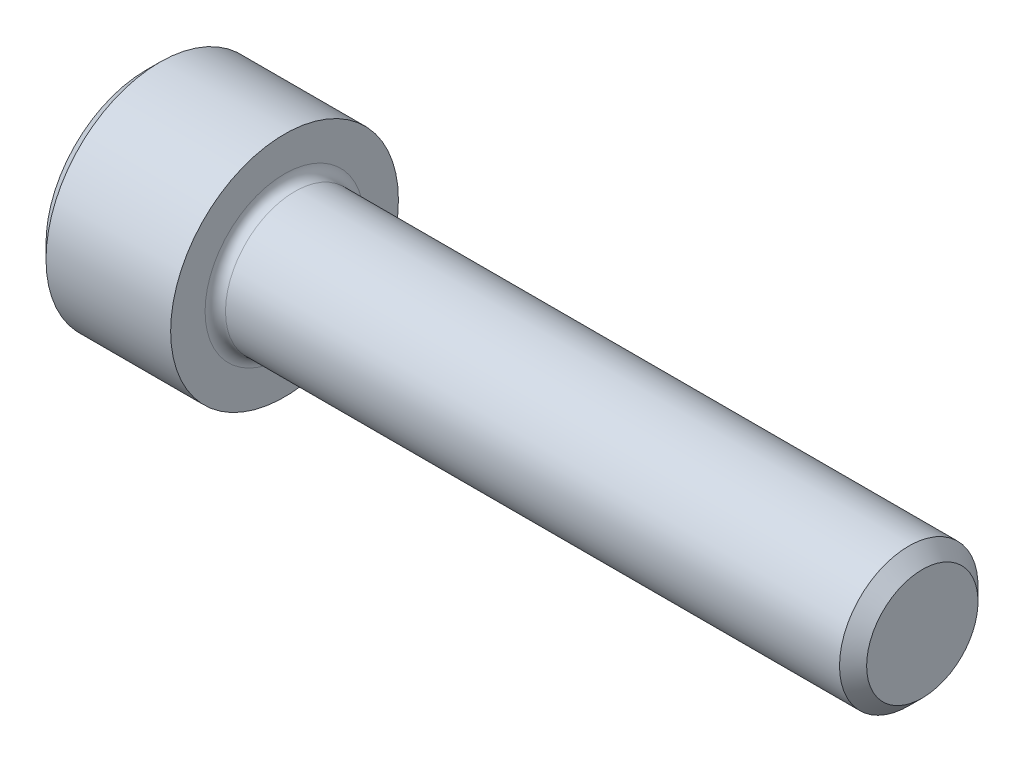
ISO-10303-21;
HEADER;
FILE_DESCRIPTION(('STEP AP214'),'2;1');
FILE_NAME('part.step','',(''),(''),'','','');
FILE_SCHEMA(('AUTOMOTIVE_DESIGN { 1 0 10303 214 1 1 1 1 }'));
ENDSEC;
DATA;
#1=APPLICATION_CONTEXT('core data for automotive mechanical design processes');
#2=APPLICATION_PROTOCOL_DEFINITION('international standard','automotive_design',2000,#1);
#3=PRODUCT_CONTEXT('',#1,'mechanical');
#4=PRODUCT('Part','Part','',(#3));
#5=PRODUCT_RELATED_PRODUCT_CATEGORY('part','',(#4));
#6=PRODUCT_DEFINITION_FORMATION('','',#4);
#7=PRODUCT_DEFINITION_CONTEXT('part definition',#1,'design');
#8=PRODUCT_DEFINITION('design','',#6,#7);
#9=PRODUCT_DEFINITION_SHAPE('','',#8);
#10=(LENGTH_UNIT() NAMED_UNIT(*) SI_UNIT(.MILLI.,.METRE.));
#11=(NAMED_UNIT(*) PLANE_ANGLE_UNIT() SI_UNIT($,.RADIAN.));
#12=(NAMED_UNIT(*) SI_UNIT($,.STERADIAN.) SOLID_ANGLE_UNIT());
#13=UNCERTAINTY_MEASURE_WITH_UNIT(LENGTH_MEASURE(1.E-05),#10,'distance_accuracy_value','');
#14=(GEOMETRIC_REPRESENTATION_CONTEXT(3) GLOBAL_UNCERTAINTY_ASSIGNED_CONTEXT((#13)) GLOBAL_UNIT_ASSIGNED_CONTEXT((#10,
#11,#12)) REPRESENTATION_CONTEXT('',''));
#15=CARTESIAN_POINT('',(0.,0.,0.));
#16=DIRECTION('',(0.,0.,1.));
#17=DIRECTION('',(1.,0.,0.));
#18=AXIS2_PLACEMENT_3D('',#15,#16,#17);
#19=CARTESIAN_POINT('',(2.286,3.4381381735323,-1.98501000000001));
#20=DIRECTION('',(1.,0.,0.));
#21=DIRECTION('',(0.,0.,-1.));
#22=AXIS2_PLACEMENT_3D('',#19,#20,#21);
#23=PLANE('',#22);
#24=DIRECTION('',(0.,1.,0.));
#25=VECTOR('',#24,1.);
#26=CARTESIAN_POINT('',(2.286,3.4381381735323,1.98501));
#27=LINE('',#26,#25);
#28=CARTESIAN_POINT('',(2.28599999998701,0.,1.98501000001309));
#29=VERTEX_POINT('',#28);
#30=CARTESIAN_POINT('',(2.286,-1.14604605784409,1.98501));
#31=VERTEX_POINT('',#30);
#32=EDGE_CURVE('E95',#29,#31,#27,.F.);
#33=ORIENTED_EDGE('',*,*,#32,.F.);
#34=CARTESIAN_POINT('',(2.2859999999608,0.,0.));
#35=DIRECTION('',(-1.,0.,0.));
#36=DIRECTION('',(0.,0.,1.));
#37=AXIS2_PLACEMENT_3D('',#34,#35,#36);
#38=CIRCLE('',#37,1.98501000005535);
#39=CARTESIAN_POINT('',(2.2859999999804,-1.71906908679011,0.992505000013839));
#40=VERTEX_POINT('',#39);
#41=EDGE_CURVE('E97',#29,#40,#38,.F.);
#42=ORIENTED_EDGE('',*,*,#41,.T.);
#43=DIRECTION('',(0.,-0.500000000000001,-0.866025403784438));
#44=VECTOR('',#43,1.);
#45=CARTESIAN_POINT('',(2.286,-1.14604605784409,1.98501));
#46=LINE('',#45,#44);
#47=EDGE_CURVE('E100',#31,#40,#46,.T.);
#48=ORIENTED_EDGE('',*,*,#47,.F.);
#49=EDGE_LOOP('',(#33,#42,#48));
#50=FACE_BOUND('',#49,.T.);
#51=ADVANCED_FACE('F16',(#50),#23,.F.);
#52=CARTESIAN_POINT('',(2.286,3.4381381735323,-1.98501000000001));
#53=DIRECTION('',(1.,0.,0.));
#54=DIRECTION('',(0.,0.,-1.));
#55=AXIS2_PLACEMENT_3D('',#52,#53,#54);
#56=PLANE('',#55);
#57=DIRECTION('',(0.,-0.500000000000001,-0.866025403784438));
#58=VECTOR('',#57,1.);
#59=CARTESIAN_POINT('',(2.286,-1.71906908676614,0.992504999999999));
#60=LINE('',#59,#58);
#61=CARTESIAN_POINT('',(2.286,-2.29209211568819,0.));
#62=VERTEX_POINT('',#61);
#63=EDGE_CURVE('E168',#40,#62,#60,.T.);
#64=ORIENTED_EDGE('',*,*,#63,.F.);
#65=CARTESIAN_POINT('',(2.2859999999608,0.,0.));
#66=DIRECTION('',(-1.,0.,0.));
#67=DIRECTION('',(0.,0.,1.));
#68=AXIS2_PLACEMENT_3D('',#65,#66,#67);
#69=CIRCLE('',#68,1.98501000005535);
#70=CARTESIAN_POINT('',(2.2859999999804,-1.71906908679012,-0.992505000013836));
#71=VERTEX_POINT('',#70);
#72=EDGE_CURVE('E115',#40,#71,#69,.F.);
#73=ORIENTED_EDGE('',*,*,#72,.T.);
#74=DIRECTION('',(0.,0.499999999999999,-0.866025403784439));
#75=VECTOR('',#74,1.);
#76=CARTESIAN_POINT('',(2.286,-2.29209211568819,0.));
#77=LINE('',#76,#75);
#78=EDGE_CURVE('E164',#62,#71,#77,.T.);
#79=ORIENTED_EDGE('',*,*,#78,.F.);
#80=EDGE_LOOP('',(#64,#73,#79));
#81=FACE_BOUND('',#80,.T.);
#82=ADVANCED_FACE('F340',(#81),#56,.F.);
#83=CARTESIAN_POINT('',(2.286,3.4381381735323,-1.98501000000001));
#84=DIRECTION('',(1.,0.,0.));
#85=DIRECTION('',(0.,0.,-1.));
#86=AXIS2_PLACEMENT_3D('',#83,#84,#85);
#87=PLANE('',#86);
#88=DIRECTION('',(0.,0.499999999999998,-0.86602540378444));
#89=VECTOR('',#88,1.);
#90=CARTESIAN_POINT('',(2.286,-1.71906908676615,-0.992504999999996));
#91=LINE('',#90,#89);
#92=CARTESIAN_POINT('',(2.286,-1.1460460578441,-1.98501));
#93=VERTEX_POINT('',#92);
#94=EDGE_CURVE('E160',#71,#93,#91,.T.);
#95=ORIENTED_EDGE('',*,*,#94,.F.);
#96=CARTESIAN_POINT('',(2.2859999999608,0.,0.));
#97=DIRECTION('',(-1.,0.,0.));
#98=DIRECTION('',(0.,0.,1.));
#99=AXIS2_PLACEMENT_3D('',#96,#97,#98);
#100=CIRCLE('',#99,1.98501000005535);
#101=CARTESIAN_POINT('',(2.28599999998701,0.,-1.98501000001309));
#102=VERTEX_POINT('',#101);
#103=EDGE_CURVE('E217',#71,#102,#100,.F.);
#104=ORIENTED_EDGE('',*,*,#103,.T.);
#105=DIRECTION('',(0.,1.,0.));
#106=VECTOR('',#105,1.);
#107=CARTESIAN_POINT('',(2.286,3.4381381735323,-1.98501));
#108=LINE('',#107,#106);
#109=EDGE_CURVE('E156',#93,#102,#108,.T.);
#110=ORIENTED_EDGE('',*,*,#109,.F.);
#111=EDGE_LOOP('',(#95,#104,#110));
#112=FACE_BOUND('',#111,.T.);
#113=ADVANCED_FACE('F337',(#112),#87,.F.);
#114=CARTESIAN_POINT('',(2.286,3.4381381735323,-1.98501000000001));
#115=DIRECTION('',(1.,0.,0.));
#116=DIRECTION('',(0.,0.,-1.));
#117=AXIS2_PLACEMENT_3D('',#114,#115,#116);
#118=PLANE('',#117);
#119=DIRECTION('',(0.,1.,0.));
#120=VECTOR('',#119,1.);
#121=CARTESIAN_POINT('',(2.286,3.4381381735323,-1.98501));
#122=LINE('',#121,#120);
#123=CARTESIAN_POINT('',(2.286,1.1460460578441,-1.98501));
#124=VERTEX_POINT('',#123);
#125=EDGE_CURVE('E152',#102,#124,#122,.T.);
#126=ORIENTED_EDGE('',*,*,#125,.F.);
#127=CARTESIAN_POINT('',(2.2859999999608,0.,0.));
#128=DIRECTION('',(-1.,0.,0.));
#129=DIRECTION('',(0.,0.,1.));
#130=AXIS2_PLACEMENT_3D('',#127,#128,#129);
#131=CIRCLE('',#130,1.98501000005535);
#132=CARTESIAN_POINT('',(2.2859999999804,1.71906908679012,-0.992505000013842));
#133=VERTEX_POINT('',#132);
#134=EDGE_CURVE('E214',#102,#133,#131,.F.);
#135=ORIENTED_EDGE('',*,*,#134,.T.);
#136=DIRECTION('',(0.,0.500000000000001,0.866025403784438));
#137=VECTOR('',#136,1.);
#138=CARTESIAN_POINT('',(2.286,1.1460460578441,-1.98501));
#139=LINE('',#138,#137);
#140=EDGE_CURVE('E148',#124,#133,#139,.T.);
#141=ORIENTED_EDGE('',*,*,#140,.F.);
#142=EDGE_LOOP('',(#126,#135,#141));
#143=FACE_BOUND('',#142,.T.);
#144=ADVANCED_FACE('F333',(#143),#118,.F.);
#145=CARTESIAN_POINT('',(2.286,3.4381381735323,-1.98501000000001));
#146=DIRECTION('',(1.,0.,0.));
#147=DIRECTION('',(0.,0.,-1.));
#148=AXIS2_PLACEMENT_3D('',#145,#146,#147);
#149=PLANE('',#148);
#150=DIRECTION('',(0.,0.500000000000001,0.866025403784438));
#151=VECTOR('',#150,1.);
#152=CARTESIAN_POINT('',(2.286,1.71906908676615,-0.992505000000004));
#153=LINE('',#152,#151);
#154=CARTESIAN_POINT('',(2.286,2.2920921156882,0.));
#155=VERTEX_POINT('',#154);
#156=EDGE_CURVE('E144',#133,#155,#153,.T.);
#157=ORIENTED_EDGE('',*,*,#156,.F.);
#158=CARTESIAN_POINT('',(2.2859999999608,0.,0.));
#159=DIRECTION('',(-1.,0.,0.));
#160=DIRECTION('',(0.,0.,1.));
#161=AXIS2_PLACEMENT_3D('',#158,#159,#160);
#162=CIRCLE('',#161,1.98501000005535);
#163=CARTESIAN_POINT('',(2.2859999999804,1.71906908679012,0.992505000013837));
#164=VERTEX_POINT('',#163);
#165=EDGE_CURVE('E123',#133,#164,#162,.F.);
#166=ORIENTED_EDGE('',*,*,#165,.T.);
#167=DIRECTION('',(0.,-0.499999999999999,0.866025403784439));
#168=VECTOR('',#167,1.);
#169=CARTESIAN_POINT('',(2.286,2.2920921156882,0.));
#170=LINE('',#169,#168);
#171=EDGE_CURVE('E116',#155,#164,#170,.T.);
#172=ORIENTED_EDGE('',*,*,#171,.F.);
#173=EDGE_LOOP('',(#157,#166,#172));
#174=FACE_BOUND('',#173,.T.);
#175=ADVANCED_FACE('F329',(#174),#149,.F.);
#176=CARTESIAN_POINT('',(2.28600000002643,0.,0.));
#177=DIRECTION('',(-1.,0.,0.));
#178=DIRECTION('',(0.,0.,1.));
#179=AXIS2_PLACEMENT_3D('',#176,#177,#178);
#180=CONICAL_SURFACE('',#179,1.98500999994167,1.04719755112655);
#181=CARTESIAN_POINT('',(3.43204605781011,0.,5.6843418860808E-11));
#182=VERTEX_POINT('',#181);
#183=VERTEX_LOOP('',#182);
#184=FACE_BOUND('',#183,.T.);
#185=ORIENTED_EDGE('',*,*,#41,.F.);
#186=CARTESIAN_POINT('',(2.2859999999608,0.,0.));
#187=DIRECTION('',(-1.,0.,0.));
#188=DIRECTION('',(0.,0.,1.));
#189=AXIS2_PLACEMENT_3D('',#186,#187,#188);
#190=CIRCLE('',#189,1.98501000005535);
#191=EDGE_CURVE('E111',#29,#164,#190,.T.);
#192=ORIENTED_EDGE('',*,*,#191,.T.);
#193=ORIENTED_EDGE('',*,*,#165,.F.);
#194=ORIENTED_EDGE('',*,*,#134,.F.);
#195=ORIENTED_EDGE('',*,*,#103,.F.);
#196=ORIENTED_EDGE('',*,*,#72,.F.);
#197=EDGE_LOOP('',(#185,#192,#193,#194,#195,#196));
#198=FACE_BOUND('',#197,.T.);
#199=ADVANCED_FACE('F109',(#184,#198),#180,.F.);
#200=CARTESIAN_POINT('',(2.286,3.4381381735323,-1.98501000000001));
#201=DIRECTION('',(1.,0.,0.));
#202=DIRECTION('',(0.,0.,-1.));
#203=AXIS2_PLACEMENT_3D('',#200,#201,#202);
#204=PLANE('',#203);
#205=DIRECTION('',(0.,0.499999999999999,-0.866025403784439));
#206=VECTOR('',#205,1.);
#207=CARTESIAN_POINT('',(2.286,2.2920921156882,0.));
#208=LINE('',#207,#206);
#209=CARTESIAN_POINT('',(2.286,1.14604605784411,1.98501));
#210=VERTEX_POINT('',#209);
#211=EDGE_CURVE('E122',#164,#210,#208,.F.);
#212=ORIENTED_EDGE('',*,*,#211,.F.);
#213=ORIENTED_EDGE('',*,*,#191,.F.);
#214=DIRECTION('',(0.,-1.,0.));
#215=VECTOR('',#214,1.);
#216=CARTESIAN_POINT('',(2.286,-1.14604605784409,1.98501));
#217=LINE('',#216,#215);
#218=EDGE_CURVE('E120',#29,#210,#217,.F.);
#219=ORIENTED_EDGE('',*,*,#218,.T.);
#220=EDGE_LOOP('',(#212,#213,#219));
#221=FACE_BOUND('',#220,.T.);
#222=ADVANCED_FACE('F119',(#221),#204,.F.);
#223=CARTESIAN_POINT('',(2.286,2.2920921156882,0.));
#224=DIRECTION('',(0.,-0.866025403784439,-0.499999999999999));
#225=DIRECTION('',(0.,0.499999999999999,-0.866025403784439));
#226=AXIS2_PLACEMENT_3D('',#223,#224,#225);
#227=PLANE('',#226);
#228=ORIENTED_EDGE('',*,*,#211,.T.);
#229=DIRECTION('',(1.,0.,0.));
#230=VECTOR('',#229,1.);
#231=CARTESIAN_POINT('',(2.286,1.14604605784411,1.98501));
#232=LINE('',#231,#230);
#233=CARTESIAN_POINT('',(0.,1.14604605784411,1.98501));
#234=VERTEX_POINT('',#233);
#235=EDGE_CURVE('E128',#210,#234,#232,.F.);
#236=ORIENTED_EDGE('',*,*,#235,.T.);
#237=DIRECTION('',(0.,-0.499999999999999,0.866025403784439));
#238=VECTOR('',#237,1.);
#239=CARTESIAN_POINT('',(0.,2.2920921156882,0.));
#240=LINE('',#239,#238);
#241=CARTESIAN_POINT('',(0.,2.2920921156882,0.));
#242=VERTEX_POINT('',#241);
#243=EDGE_CURVE('E135',#242,#234,#240,.T.);
#244=ORIENTED_EDGE('',*,*,#243,.F.);
#245=DIRECTION('',(1.,0.,0.));
#246=VECTOR('',#245,1.);
#247=CARTESIAN_POINT('',(2.286,2.2920921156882,0.));
#248=LINE('',#247,#246);
#249=EDGE_CURVE('E179',#242,#155,#248,.T.);
#250=ORIENTED_EDGE('',*,*,#249,.T.);
#251=ORIENTED_EDGE('',*,*,#171,.T.);
#252=EDGE_LOOP('',(#228,#236,#244,#250,#251));
#253=FACE_BOUND('',#252,.T.);
#254=ADVANCED_FACE('F321',(#253),#227,.T.);
#255=CARTESIAN_POINT('',(2.286,-1.14604605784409,1.98501));
#256=DIRECTION('',(0.,0.,1.));
#257=DIRECTION('',(0.,-1.,0.));
#258=AXIS2_PLACEMENT_3D('',#255,#256,#257);
#259=PLANE('',#258);
#260=ORIENTED_EDGE('',*,*,#235,.F.);
#261=ORIENTED_EDGE('',*,*,#218,.F.);
#262=ORIENTED_EDGE('',*,*,#32,.T.);
#263=DIRECTION('',(1.,0.,0.));
#264=VECTOR('',#263,1.);
#265=CARTESIAN_POINT('',(2.286,-1.14604605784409,1.98501));
#266=LINE('',#265,#264);
#267=CARTESIAN_POINT('',(0.,-1.14604605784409,1.98501));
#268=VERTEX_POINT('',#267);
#269=EDGE_CURVE('E130',#268,#31,#266,.T.);
#270=ORIENTED_EDGE('',*,*,#269,.F.);
#271=DIRECTION('',(0.,1.,0.));
#272=VECTOR('',#271,1.);
#273=CARTESIAN_POINT('',(0.,0.,1.98501));
#274=LINE('',#273,#272);
#275=EDGE_CURVE('E364',#234,#268,#274,.F.);
#276=ORIENTED_EDGE('',*,*,#275,.F.);
#277=EDGE_LOOP('',(#260,#261,#262,#270,#276));
#278=FACE_BOUND('',#277,.T.);
#279=ADVANCED_FACE('F126',(#278),#259,.F.);
#280=CARTESIAN_POINT('',(2.286,-1.14604605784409,1.98501));
#281=DIRECTION('',(0.,0.866025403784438,-0.500000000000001));
#282=DIRECTION('',(0.,0.500000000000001,0.866025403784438));
#283=AXIS2_PLACEMENT_3D('',#280,#281,#282);
#284=PLANE('',#283);
#285=ORIENTED_EDGE('',*,*,#63,.T.);
#286=DIRECTION('',(1.,0.,0.));
#287=VECTOR('',#286,1.);
#288=CARTESIAN_POINT('',(2.286,-2.29209211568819,0.));
#289=LINE('',#288,#287);
#290=CARTESIAN_POINT('',(0.,-2.29209211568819,0.));
#291=VERTEX_POINT('',#290);
#292=EDGE_CURVE('E190',#291,#62,#289,.T.);
#293=ORIENTED_EDGE('',*,*,#292,.F.);
#294=DIRECTION('',(0.,-0.500000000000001,-0.866025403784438));
#295=VECTOR('',#294,1.);
#296=CARTESIAN_POINT('',(0.,-1.14604605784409,1.98501));
#297=LINE('',#296,#295);
#298=EDGE_CURVE('E360',#268,#291,#297,.T.);
#299=ORIENTED_EDGE('',*,*,#298,.F.);
#300=ORIENTED_EDGE('',*,*,#269,.T.);
#301=ORIENTED_EDGE('',*,*,#47,.T.);
#302=EDGE_LOOP('',(#285,#293,#299,#300,#301));
#303=FACE_BOUND('',#302,.T.);
#304=ADVANCED_FACE('F314',(#303),#284,.T.);
#305=CARTESIAN_POINT('',(2.286,-2.29209211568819,0.));
#306=DIRECTION('',(0.,0.866025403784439,0.499999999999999));
#307=DIRECTION('',(0.,-0.499999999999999,0.866025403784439));
#308=AXIS2_PLACEMENT_3D('',#305,#306,#307);
#309=PLANE('',#308);
#310=ORIENTED_EDGE('',*,*,#94,.T.);
#311=DIRECTION('',(1.,0.,0.));
#312=VECTOR('',#311,1.);
#313=CARTESIAN_POINT('',(2.286,-1.1460460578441,-1.98501));
#314=LINE('',#313,#312);
#315=CARTESIAN_POINT('',(0.,-1.1460460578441,-1.98501));
#316=VERTEX_POINT('',#315);
#317=EDGE_CURVE('E183',#93,#316,#314,.F.);
#318=ORIENTED_EDGE('',*,*,#317,.T.);
#319=DIRECTION('',(0.,0.499999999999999,-0.866025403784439));
#320=VECTOR('',#319,1.);
#321=CARTESIAN_POINT('',(0.,-2.29209211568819,0.));
#322=LINE('',#321,#320);
#323=EDGE_CURVE('E353',#291,#316,#322,.T.);
#324=ORIENTED_EDGE('',*,*,#323,.F.);
#325=ORIENTED_EDGE('',*,*,#292,.T.);
#326=ORIENTED_EDGE('',*,*,#78,.T.);
#327=EDGE_LOOP('',(#310,#318,#324,#325,#326));
#328=FACE_BOUND('',#327,.T.);
#329=ADVANCED_FACE('F310',(#328),#309,.T.);
#330=CARTESIAN_POINT('',(2.286,1.1460460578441,-1.98501));
#331=DIRECTION('',(0.,0.,-1.));
#332=DIRECTION('',(0.,1.,0.));
#333=AXIS2_PLACEMENT_3D('',#330,#331,#332);
#334=PLANE('',#333);
#335=ORIENTED_EDGE('',*,*,#317,.F.);
#336=ORIENTED_EDGE('',*,*,#109,.T.);
#337=ORIENTED_EDGE('',*,*,#125,.T.);
#338=DIRECTION('',(1.,0.,0.));
#339=VECTOR('',#338,1.);
#340=CARTESIAN_POINT('',(2.286,1.1460460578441,-1.98501));
#341=LINE('',#340,#339);
#342=CARTESIAN_POINT('',(0.,1.1460460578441,-1.98501));
#343=VERTEX_POINT('',#342);
#344=EDGE_CURVE('E182',#124,#343,#341,.F.);
#345=ORIENTED_EDGE('',*,*,#344,.T.);
#346=DIRECTION('',(0.,1.,0.));
#347=VECTOR('',#346,1.);
#348=CARTESIAN_POINT('',(0.,0.,-1.98501));
#349=LINE('',#348,#347);
#350=EDGE_CURVE('E359',#316,#343,#349,.T.);
#351=ORIENTED_EDGE('',*,*,#350,.F.);
#352=EDGE_LOOP('',(#335,#336,#337,#345,#351));
#353=FACE_BOUND('',#352,.T.);
#354=ADVANCED_FACE('F306',(#353),#334,.F.);
#355=CARTESIAN_POINT('',(2.286,2.2920921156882,0.));
#356=DIRECTION('',(0.,0.866025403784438,-0.500000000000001));
#357=DIRECTION('',(0.,0.500000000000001,0.866025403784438));
#358=AXIS2_PLACEMENT_3D('',#355,#356,#357);
#359=PLANE('',#358);
#360=ORIENTED_EDGE('',*,*,#344,.F.);
#361=ORIENTED_EDGE('',*,*,#140,.T.);
#362=ORIENTED_EDGE('',*,*,#156,.T.);
#363=ORIENTED_EDGE('',*,*,#249,.F.);
#364=DIRECTION('',(0.,0.500000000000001,0.866025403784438));
#365=VECTOR('',#364,1.);
#366=CARTESIAN_POINT('',(0.,1.1460460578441,-1.98501));
#367=LINE('',#366,#365);
#368=EDGE_CURVE('E210',#343,#242,#367,.T.);
#369=ORIENTED_EDGE('',*,*,#368,.F.);
#370=EDGE_LOOP('',(#360,#361,#362,#363,#369));
#371=FACE_BOUND('',#370,.T.);
#372=ADVANCED_FACE('F302',(#371),#359,.F.);
#373=CARTESIAN_POINT('',(0.,0.,0.));
#374=DIRECTION('',(-1.,0.,0.));
#375=DIRECTION('',(0.,0.,1.));
#376=AXIS2_PLACEMENT_3D('',#373,#374,#375);
#377=PLANE('',#376);
#378=CARTESIAN_POINT('',(0.,0.,0.));
#379=DIRECTION('',(1.,0.,0.));
#380=DIRECTION('',(0.,1.,0.));
#381=AXIS2_PLACEMENT_3D('',#378,#379,#380);
#382=CIRCLE('',#381,3.48615000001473);
#383=CARTESIAN_POINT('',(0.,3.48615000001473,0.));
#384=VERTEX_POINT('',#383);
#385=EDGE_CURVE('E208',#384,#384,#382,.T.);
#386=ORIENTED_EDGE('',*,*,#385,.F.);
#387=EDGE_LOOP('',(#386));
#388=FACE_BOUND('',#387,.T.);
#389=ORIENTED_EDGE('',*,*,#350,.T.);
#390=ORIENTED_EDGE('',*,*,#368,.T.);
#391=ORIENTED_EDGE('',*,*,#243,.T.);
#392=ORIENTED_EDGE('',*,*,#275,.T.);
#393=ORIENTED_EDGE('',*,*,#298,.T.);
#394=ORIENTED_EDGE('',*,*,#323,.T.);
#395=EDGE_LOOP('',(#389,#390,#391,#392,#393,#394));
#396=FACE_BOUND('',#395,.T.);
#397=ADVANCED_FACE('F294',(#388,#396),#377,.T.);
#398=CARTESIAN_POINT('',(0.482599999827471,0.,0.));
#399=DIRECTION('',(1.,0.,0.));
#400=DIRECTION('',(0.,1.,0.));
#401=AXIS2_PLACEMENT_3D('',#398,#399,#400);
#402=CONICAL_SURFACE('',#401,3.9687499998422,0.785398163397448);
#403=ORIENTED_EDGE('',*,*,#385,.T.);
#404=EDGE_LOOP('',(#403));
#405=FACE_BOUND('',#404,.T.);
#406=CARTESIAN_POINT('',(0.4826,0.,0.));
#407=DIRECTION('',(-1.,0.,0.));
#408=DIRECTION('',(0.,0.,1.));
#409=AXIS2_PLACEMENT_3D('',#406,#407,#408);
#410=CIRCLE('',#409,3.96875);
#411=CARTESIAN_POINT('',(0.4826,0.,3.96875));
#412=VERTEX_POINT('',#411);
#413=EDGE_CURVE('E207',#412,#412,#410,.F.);
#414=ORIENTED_EDGE('',*,*,#413,.F.);
#415=EDGE_LOOP('',(#414));
#416=FACE_BOUND('',#415,.T.);
#417=ADVANCED_FACE('F289',(#405,#416),#402,.T.);
#418=CARTESIAN_POINT('',(-31.75,0.,0.));
#419=DIRECTION('',(-1.,0.,0.));
#420=DIRECTION('',(0.,0.,1.));
#421=AXIS2_PLACEMENT_3D('',#418,#419,#420);
#422=CYLINDRICAL_SURFACE('',#421,3.96875);
#423=CARTESIAN_POINT('',(4.826,0.,0.));
#424=DIRECTION('',(-1.,0.,0.));
#425=DIRECTION('',(0.,0.,1.));
#426=AXIS2_PLACEMENT_3D('',#423,#424,#425);
#427=CIRCLE('',#426,3.96875);
#428=CARTESIAN_POINT('',(4.826,0.,3.96875));
#429=VERTEX_POINT('',#428);
#430=EDGE_CURVE('E204',#429,#429,#427,.F.);
#431=ORIENTED_EDGE('',*,*,#430,.F.);
#432=EDGE_LOOP('',(#431));
#433=FACE_BOUND('',#432,.T.);
#434=ORIENTED_EDGE('',*,*,#413,.T.);
#435=EDGE_LOOP('',(#434));
#436=FACE_BOUND('',#435,.T.);
#437=ADVANCED_FACE('F285',(#433,#436),#422,.T.);
#438=CARTESIAN_POINT('',(27.051,1.94056,0.));
#439=DIRECTION('',(1.,0.,0.));
#440=DIRECTION('',(0.,0.,-1.));
#441=AXIS2_PLACEMENT_3D('',#438,#439,#440);
#442=PLANE('',#441);
#443=CARTESIAN_POINT('',(27.0509999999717,0.,0.));
#444=DIRECTION('',(-1.,0.,0.));
#445=DIRECTION('',(0.,0.,1.));
#446=AXIS2_PLACEMENT_3D('',#443,#444,#445);
#447=CIRCLE('',#446,1.94055999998);
#448=CARTESIAN_POINT('',(27.0509999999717,0.,1.94055999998));
#449=VERTEX_POINT('',#448);
#450=EDGE_CURVE('E200',#449,#449,#447,.T.);
#451=ORIENTED_EDGE('',*,*,#450,.F.);
#452=EDGE_LOOP('',(#451));
#453=FACE_BOUND('',#452,.T.);
#454=ADVANCED_FACE('F243',(#453),#442,.T.);
#455=CARTESIAN_POINT('',(4.826,3.96875,0.));
#456=DIRECTION('',(1.,0.,0.));
#457=DIRECTION('',(0.,0.,-1.));
#458=AXIS2_PLACEMENT_3D('',#455,#456,#457);
#459=PLANE('',#458);
#460=ORIENTED_EDGE('',*,*,#430,.T.);
#461=EDGE_LOOP('',(#460));
#462=FACE_BOUND('',#461,.T.);
#463=CARTESIAN_POINT('',(4.826,0.,0.));
#464=DIRECTION('',(1.,0.,0.));
#465=DIRECTION('',(0.,0.,1.));
#466=AXIS2_PLACEMENT_3D('',#463,#464,#465);
#467=CIRCLE('',#466,2.76859999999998);
#468=CARTESIAN_POINT('',(4.826,0.,-2.76859999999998));
#469=VERTEX_POINT('',#468);
#470=CARTESIAN_POINT('',(4.826,0.,2.76859999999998));
#471=VERTEX_POINT('',#470);
#472=EDGE_CURVE('E203',#469,#471,#467,.F.);
#473=ORIENTED_EDGE('',*,*,#472,.T.);
#474=CARTESIAN_POINT('',(4.826,0.,0.));
#475=DIRECTION('',(1.,0.,0.));
#476=DIRECTION('',(0.,0.,-1.));
#477=AXIS2_PLACEMENT_3D('',#474,#475,#476);
#478=CIRCLE('',#477,2.76859999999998);
#479=EDGE_CURVE('E35',#471,#469,#478,.F.);
#480=ORIENTED_EDGE('',*,*,#479,.T.);
#481=EDGE_LOOP('',(#473,#480));
#482=FACE_BOUND('',#481,.T.);
#483=ADVANCED_FACE('F224',(#462,#482),#459,.T.);
#484=CARTESIAN_POINT('',(26.5785600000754,0.,0.));
#485=DIRECTION('',(-1.,0.,0.));
#486=DIRECTION('',(0.,0.,1.));
#487=AXIS2_PLACEMENT_3D('',#484,#485,#486);
#488=CONICAL_SURFACE('',#487,2.41299999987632,0.785398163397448);
#489=CARTESIAN_POINT('',(26.57856,0.,0.));
#490=DIRECTION('',(-1.,0.,0.));
#491=DIRECTION('',(0.,0.,1.));
#492=AXIS2_PLACEMENT_3D('',#489,#490,#491);
#493=CIRCLE('',#492,2.41299999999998);
#494=CARTESIAN_POINT('',(26.57856,0.,2.41299999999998));
#495=VERTEX_POINT('',#494);
#496=EDGE_CURVE('E27',#495,#495,#493,.T.);
#497=ORIENTED_EDGE('',*,*,#496,.F.);
#498=EDGE_LOOP('',(#497));
#499=FACE_BOUND('',#498,.T.);
#500=ORIENTED_EDGE('',*,*,#450,.T.);
#501=EDGE_LOOP('',(#500));
#502=FACE_BOUND('',#501,.T.);
#503=ADVANCED_FACE('F242',(#499,#502),#488,.T.);
#504=CARTESIAN_POINT('',(5.1816,0.,0.));
#505=DIRECTION('',(1.,0.,0.));
#506=DIRECTION('',(0.,0.,-1.));
#507=AXIS2_PLACEMENT_3D('',#504,#505,#506);
#508=TOROIDAL_SURFACE('',#507,2.76859999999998,0.3556);
#509=CARTESIAN_POINT('',(5.1816,0.,0.));
#510=DIRECTION('',(-1.,0.,0.));
#511=DIRECTION('',(0.,0.,1.));
#512=AXIS2_PLACEMENT_3D('',#509,#510,#511);
#513=CIRCLE('',#512,2.41299999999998);
#514=CARTESIAN_POINT('',(5.1816,0.,2.41299999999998));
#515=VERTEX_POINT('',#514);
#516=EDGE_CURVE('E11',#515,#515,#513,.F.);
#517=ORIENTED_EDGE('',*,*,#516,.F.);
#518=EDGE_LOOP('',(#517));
#519=FACE_BOUND('',#518,.T.);
#520=ORIENTED_EDGE('',*,*,#472,.F.);
#521=ORIENTED_EDGE('',*,*,#479,.F.);
#522=EDGE_LOOP('',(#520,#521));
#523=FACE_BOUND('',#522,.T.);
#524=ADVANCED_FACE('F221',(#519,#523),#508,.F.);
#525=CARTESIAN_POINT('',(-31.75,0.,0.));
#526=DIRECTION('',(-1.,0.,0.));
#527=DIRECTION('',(0.,0.,1.));
#528=AXIS2_PLACEMENT_3D('',#525,#526,#527);
#529=CYLINDRICAL_SURFACE('',#528,2.41299999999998);
#530=ORIENTED_EDGE('',*,*,#516,.T.);
#531=EDGE_LOOP('',(#530));
#532=FACE_BOUND('',#531,.T.);
#533=ORIENTED_EDGE('',*,*,#496,.T.);
#534=EDGE_LOOP('',(#533));
#535=FACE_BOUND('',#534,.T.);
#536=ADVANCED_FACE('F267',(#532,#535),#529,.T.);
#537=CLOSED_SHELL('',(#51,#82,#113,#144,#175,#199,#222,#254,#279,#304,#329,#354,#372,#397,#417,
#437,#454,#483,#503,#524,#536));
#538=MANIFOLD_SOLID_BREP('B1',#537);
#539=ADVANCED_BREP_SHAPE_REPRESENTATION('',(#18,#538),#14);
#540=SHAPE_DEFINITION_REPRESENTATION(#9,#539);
ENDSEC;
END-ISO-10303-21;
